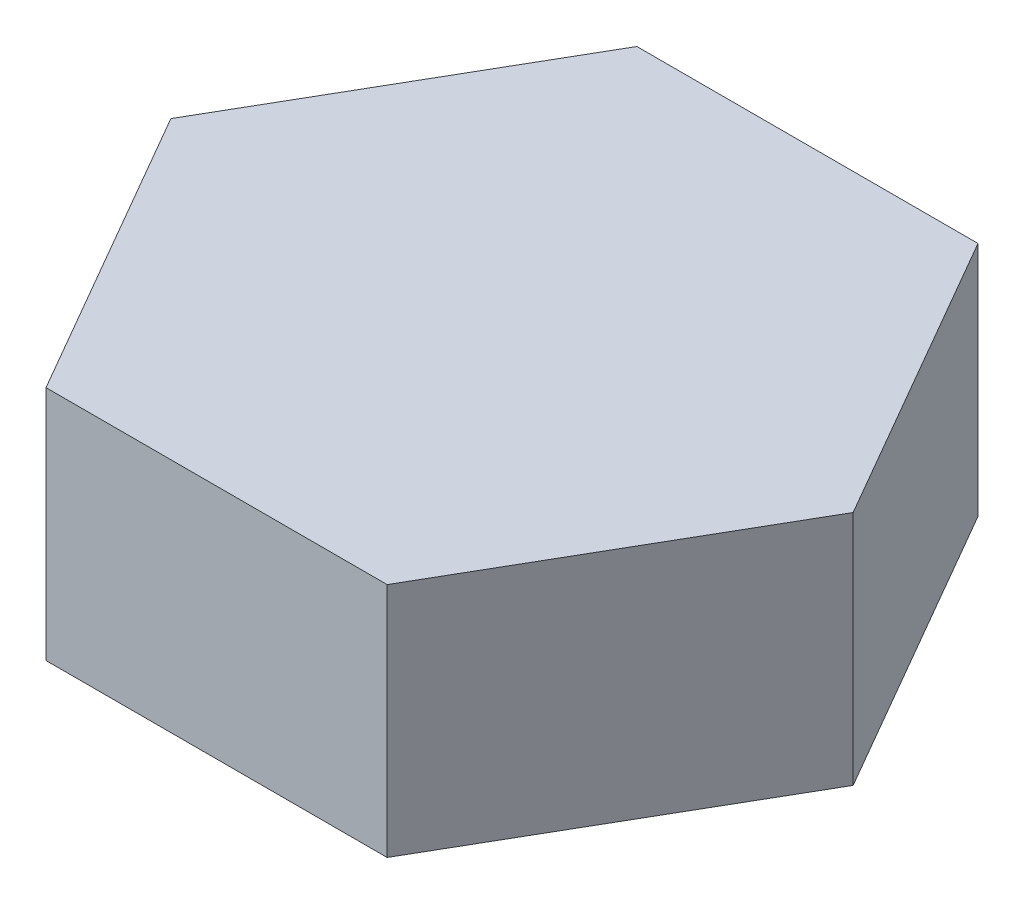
from build123d import *

# Parameters (mm, degrees)
EXTRUDE1_DEPTH = 40


with BuildPart() as part:
    # Sketch1 → Extrude1 (new body)
    with BuildSketch(Plane(origin=(0, 0, 0), x_dir=(1, 0, 0), z_dir=(0, 1, 0))):
        Polygon((57.735026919, 0), (28.867513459, 50), (-28.867513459, 50), (-57.735026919, 0), (-28.867513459, -50), (28.867513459, -50), align=None)
    extrude(amount=EXTRUDE1_DEPTH)


solid = part.part
